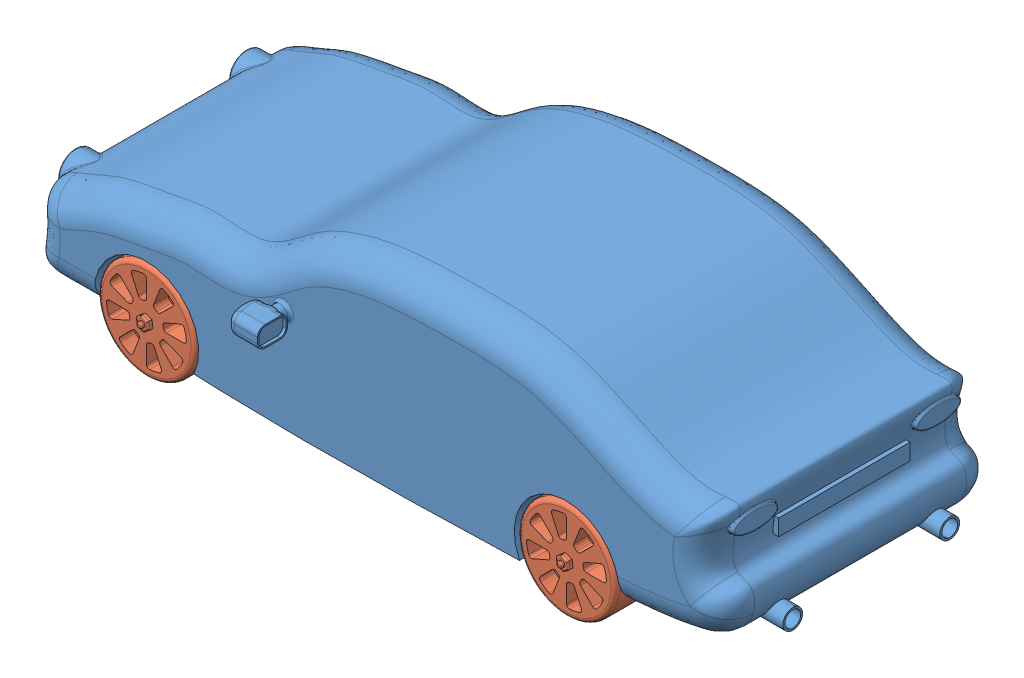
SolidWorks assembly Voiture.SLDASM, configuration Défaut (file format 5000). Lengths in mm.
Overall size (9560 3571.77 4680).
5 component instances, 2 part files, 8 mates.
Components (placement in the parent):
- Carrosserie-1: Carrosserie.SLDPRT [Défaut] at (-272.5 -204.819 0) size (9560 3042.74 4680)
- roue-1: roue.SLDPRT [Défaut] at (-3436.6513 -949.7321 1576.9208) size (1311.81 1311.81 700)
- roue-2: roue.SLDPRT [Défaut] at (2191.1496 -916.0265 1576.9208) size (1311.81 1311.81 700)
- roue-3: roue.SLDPRT [Défaut] at (-3461.2647 -826.1203 -1394.9483) x (0.923728 0.383049 0) z (0 0 -1) size (1311.81 1311.81 700)
- roue-4: roue.SLDPRT [Défaut] at (2166.5362 -792.4146 -1394.9483) x (0.923728 0.383049 0) z (0 0 -1) size (1311.81 1311.81 700)
Mates (geometry in assembly coordinates):
- Coïncidente1: coincident anti-aligned: plane of Carrosserie-1 through (-3319.8076 -862.21 1310.9862) normal (0 0 1); plane of roue-1 through (-3319.8076 -862.21 1310.9862) normal (0 0 -1)
- Coaxiale1: concentric anti-aligned: cylinder of Carrosserie-1 through (-3319.8076 -862.21 1310.9862) axis (0 0 1) radius 700; cylinder of roue-1 through (-3319.8076 -862.21 1910.9862) axis (0 0 -1) radius 655.9043
- Coïncidente5: coincident anti-aligned: plane of Carrosserie-1 through (2307.9933 -828.5044 1310.9862) normal (0 0 1); plane of roue-2 through (2307.9933 -828.5044 1310.9862) normal (0 0 -1)
- Coaxiale2: concentric anti-aligned: cylinder of Carrosserie-1 through (2307.9933 -828.5044 1310.9862) axis (0 0 1) radius 700; cylinder of roue-2 through (2307.9933 -828.5044 1910.9862) axis (0 0 -1) radius 655.9043
- Coaxiale3: concentric anti-aligned: cylinder of Carrosserie-1 through (-3319.8076 -862.21 -1129.0138) axis (0 0 -1) radius 700; cylinder of roue-3 through (-3319.8076 -862.21 -1729.0138) axis (0 0 1) radius 655.9043
- Coaxiale4: concentric anti-aligned: cylinder of Carrosserie-1 through (2307.9933 -828.5044 -1129.0138) axis (0 0 -1) radius 700; cylinder of roue-4 through (2307.9933 -828.5044 -1729.0138) axis (0 0 1) radius 655.9043
- Coïncidente7: coincident anti-aligned: plane of Carrosserie-1 through (2307.9933 -828.5044 -1129.0138) normal (0 0 -1); plane of roue-4 through (2307.9933 -828.5044 -1129.0138) normal (0 0 1)
- Coïncidente8: coincident anti-aligned: plane of Carrosserie-1 through (-3319.8076 -862.21 -1129.0138) normal (0 0 -1); plane of roue-3 through (-3319.8076 -862.21 -1129.0138) normal (0 0 1)
